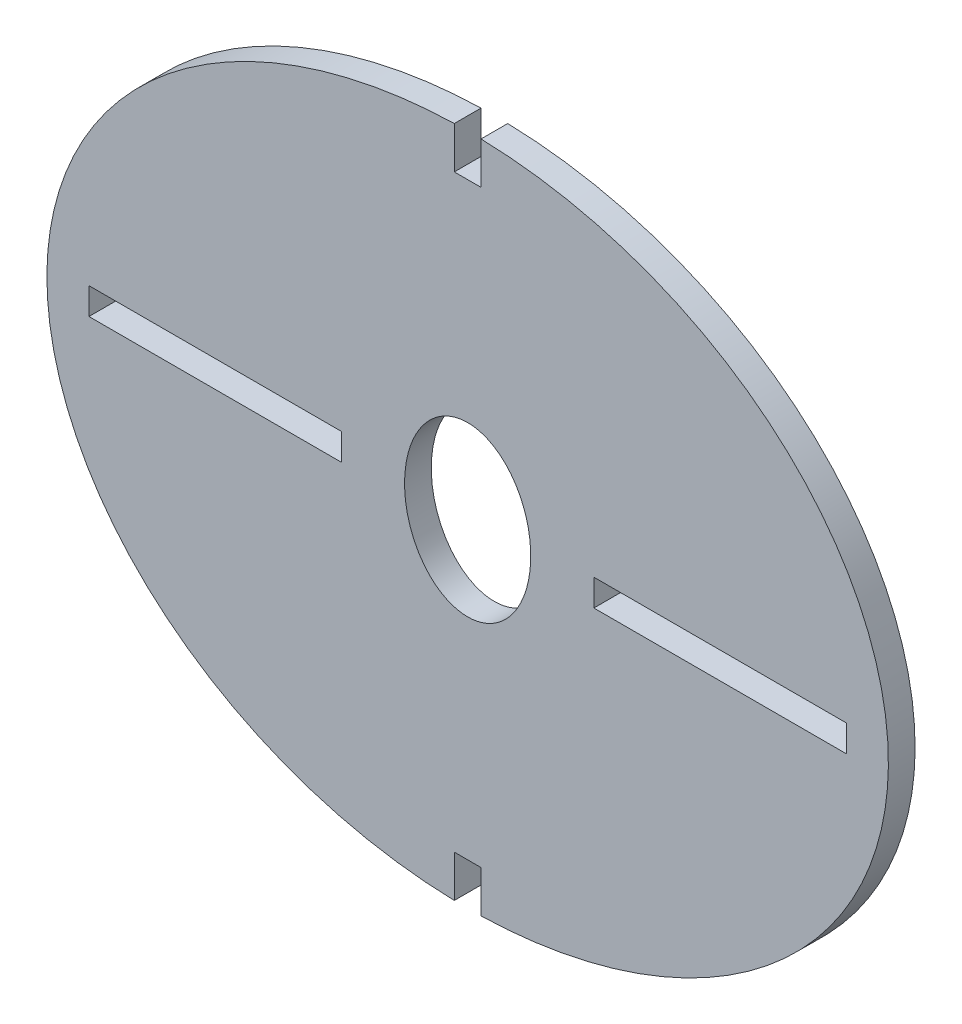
from build123d import *

# Parameters (mm, degrees)
SKETCH1_RX          = 50
SKETCH1_RY          = 40
SKETCH1_RX_2        = 10
SKETCH1_RY_2        = 7.5
SKETCH1_W           = 30
SKETCH1_H           = 3.175
BOSS_EXTRUDE1_DEPTH = 3.175
CUT_EXTRUDE1_DEPTH  = 10


with BuildPart() as part:
    # Sketch1 → Boss-Extrude1 (new body)
    with BuildSketch(Plane.XY):
        with Locations(Location((0, 0), (0, 0, 180))):
            Ellipse(SKETCH1_RX, SKETCH1_RY)
        with Locations(Location((0, 0), (0, 0, -90))):
            Ellipse(SKETCH1_RX_2, SKETCH1_RY_2, mode=Mode.SUBTRACT)
        with Locations((-30, 0)):
            Rectangle(SKETCH1_W, SKETCH1_H, mode=Mode.SUBTRACT)
        with Locations((30, 0)):
            Rectangle(SKETCH1_W, SKETCH1_H, mode=Mode.SUBTRACT)
    extrude(amount=BOSS_EXTRUDE1_DEPTH)

    # Sketch2 → Cut-Extrude1 (cut)
    with BuildSketch(Plane.XY.offset(3.175)):
        Polygon((0, 35), (-1.5875, 35), (-1.5875, 61.396872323), (1.5875, 61.396872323), (1.5875, 35), align=None)
        Polygon((-1.5875, -61.396872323), (1.5875, -61.396872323), (1.5875, -35), (0, -35), (-1.5875, -35), align=None)
    extrude(amount=-CUT_EXTRUDE1_DEPTH, mode=Mode.SUBTRACT)


solid = part.part
